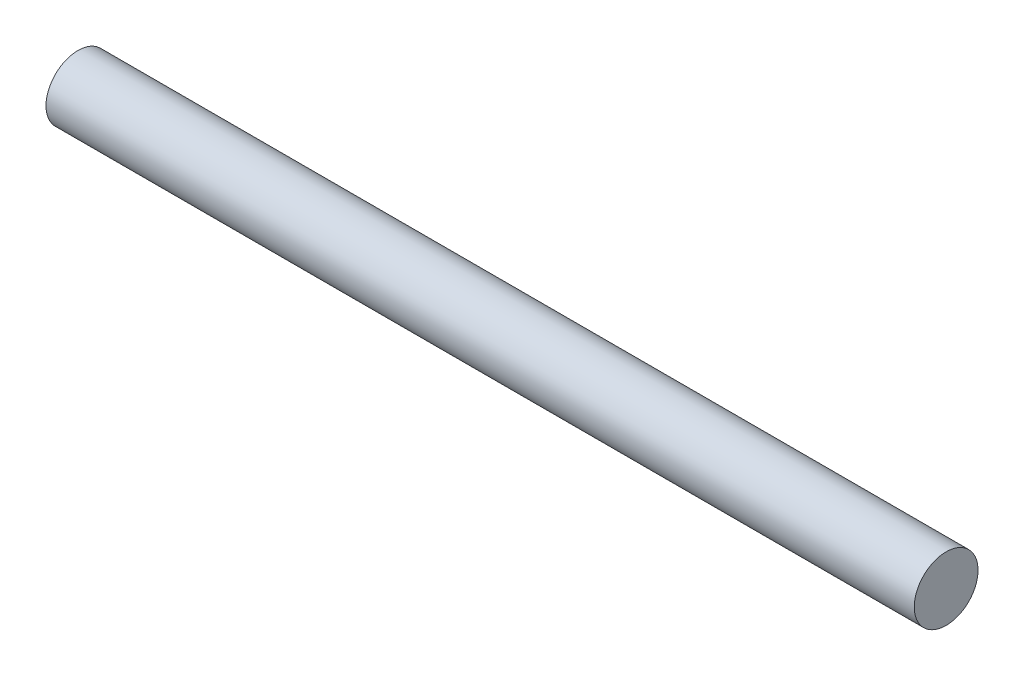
ISO-10303-21;
HEADER;
FILE_DESCRIPTION(('STEP AP214'),'2;1');
FILE_NAME('part.step','',(''),(''),'','','');
FILE_SCHEMA(('AUTOMOTIVE_DESIGN { 1 0 10303 214 1 1 1 1 }'));
ENDSEC;
DATA;
#1=APPLICATION_CONTEXT('core data for automotive mechanical design processes');
#2=APPLICATION_PROTOCOL_DEFINITION('international standard','automotive_design',2000,#1);
#3=PRODUCT_CONTEXT('',#1,'mechanical');
#4=PRODUCT('Part','Part','',(#3));
#5=PRODUCT_RELATED_PRODUCT_CATEGORY('part','',(#4));
#6=PRODUCT_DEFINITION_FORMATION('','',#4);
#7=PRODUCT_DEFINITION_CONTEXT('part definition',#1,'design');
#8=PRODUCT_DEFINITION('design','',#6,#7);
#9=PRODUCT_DEFINITION_SHAPE('','',#8);
#10=(LENGTH_UNIT() NAMED_UNIT(*) SI_UNIT(.MILLI.,.METRE.));
#11=(NAMED_UNIT(*) PLANE_ANGLE_UNIT() SI_UNIT($,.RADIAN.));
#12=(NAMED_UNIT(*) SI_UNIT($,.STERADIAN.) SOLID_ANGLE_UNIT());
#13=UNCERTAINTY_MEASURE_WITH_UNIT(LENGTH_MEASURE(1.E-05),#10,'distance_accuracy_value','');
#14=(GEOMETRIC_REPRESENTATION_CONTEXT(3) GLOBAL_UNCERTAINTY_ASSIGNED_CONTEXT((#13)) GLOBAL_UNIT_ASSIGNED_CONTEXT((#10,
#11,#12)) REPRESENTATION_CONTEXT('',''));
#15=CARTESIAN_POINT('',(0.,0.,0.));
#16=DIRECTION('',(0.,0.,1.));
#17=DIRECTION('',(1.,0.,0.));
#18=AXIS2_PLACEMENT_3D('',#15,#16,#17);
#19=CARTESIAN_POINT('',(38.1,0.,0.));
#20=DIRECTION('',(-1.,0.,0.));
#21=DIRECTION('',(0.,0.,1.));
#22=AXIS2_PLACEMENT_3D('',#19,#20,#21);
#23=CYLINDRICAL_SURFACE('',#22,1.4);
#24=CARTESIAN_POINT('',(38.1,0.,0.));
#25=DIRECTION('',(1.,0.,0.));
#26=DIRECTION('',(0.,0.,-1.));
#27=AXIS2_PLACEMENT_3D('',#24,#25,#26);
#28=CIRCLE('',#27,1.4);
#29=CARTESIAN_POINT('',(38.1,0.,1.4));
#30=VERTEX_POINT('',#29);
#31=EDGE_CURVE('E10',#30,#30,#28,.T.);
#32=CARTESIAN_POINT('',(0.,0.,0.));
#33=DIRECTION('',(1.,0.,0.));
#34=DIRECTION('',(0.,0.,-1.));
#35=AXIS2_PLACEMENT_3D('',#32,#33,#34);
#36=CIRCLE('',#35,1.4);
#37=CARTESIAN_POINT('',(0.,0.,1.4));
#38=VERTEX_POINT('',#37);
#39=EDGE_CURVE('E46',#38,#38,#36,.T.);
#40=CARTESIAN_POINT('',(38.1,0.,1.4));
#41=CARTESIAN_POINT('',(37.703125,0.,1.4));
#42=CARTESIAN_POINT('',(37.30625,0.,1.4));
#43=CARTESIAN_POINT('',(36.5125,0.,1.4));
#44=CARTESIAN_POINT('',(36.115625,0.,1.4));
#45=CARTESIAN_POINT('',(35.321875,0.,1.4));
#46=CARTESIAN_POINT('',(34.925,0.,1.4));
#47=CARTESIAN_POINT('',(34.13125,0.,1.4));
#48=CARTESIAN_POINT('',(33.734375,0.,1.4));
#49=CARTESIAN_POINT('',(32.940625,0.,1.4));
#50=CARTESIAN_POINT('',(32.54375,0.,1.4));
#51=CARTESIAN_POINT('',(31.75,0.,1.4));
#52=CARTESIAN_POINT('',(31.353125,0.,1.4));
#53=CARTESIAN_POINT('',(30.559375,0.,1.4));
#54=CARTESIAN_POINT('',(30.1625,0.,1.4));
#55=CARTESIAN_POINT('',(29.36875,0.,1.4));
#56=CARTESIAN_POINT('',(28.971875,0.,1.4));
#57=CARTESIAN_POINT('',(28.178125,0.,1.4));
#58=CARTESIAN_POINT('',(27.78125,0.,1.4));
#59=CARTESIAN_POINT('',(26.9875,0.,1.4));
#60=CARTESIAN_POINT('',(26.590625,0.,1.4));
#61=CARTESIAN_POINT('',(25.796875,0.,1.4));
#62=CARTESIAN_POINT('',(25.4,0.,1.4));
#63=CARTESIAN_POINT('',(24.60625,0.,1.4));
#64=CARTESIAN_POINT('',(24.209375,0.,1.4));
#65=CARTESIAN_POINT('',(23.415625,0.,1.4));
#66=CARTESIAN_POINT('',(23.01875,0.,1.4));
#67=CARTESIAN_POINT('',(22.225,0.,1.4));
#68=CARTESIAN_POINT('',(21.828125,0.,1.4));
#69=CARTESIAN_POINT('',(21.034375,0.,1.4));
#70=CARTESIAN_POINT('',(20.6375,0.,1.4));
#71=CARTESIAN_POINT('',(19.84375,0.,1.4));
#72=CARTESIAN_POINT('',(19.446875,0.,1.4));
#73=CARTESIAN_POINT('',(18.653125,0.,1.4));
#74=CARTESIAN_POINT('',(18.25625,0.,1.4));
#75=CARTESIAN_POINT('',(17.4625,0.,1.4));
#76=CARTESIAN_POINT('',(17.065625,0.,1.4));
#77=CARTESIAN_POINT('',(16.271875,0.,1.4));
#78=CARTESIAN_POINT('',(15.875,0.,1.4));
#79=CARTESIAN_POINT('',(15.08125,0.,1.4));
#80=CARTESIAN_POINT('',(14.684375,0.,1.4));
#81=CARTESIAN_POINT('',(13.890625,0.,1.4));
#82=CARTESIAN_POINT('',(13.49375,0.,1.4));
#83=CARTESIAN_POINT('',(12.7,0.,1.4));
#84=CARTESIAN_POINT('',(12.303125,0.,1.4));
#85=CARTESIAN_POINT('',(11.509375,0.,1.4));
#86=CARTESIAN_POINT('',(11.1125,0.,1.4));
#87=CARTESIAN_POINT('',(10.31875,0.,1.4));
#88=CARTESIAN_POINT('',(9.92187499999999,0.,1.4));
#89=CARTESIAN_POINT('',(9.128125,0.,1.4));
#90=CARTESIAN_POINT('',(8.73124999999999,0.,1.4));
#91=CARTESIAN_POINT('',(7.93749999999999,0.,1.4));
#92=CARTESIAN_POINT('',(7.54062499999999,0.,1.4));
#93=CARTESIAN_POINT('',(6.746875,0.,1.4));
#94=CARTESIAN_POINT('',(6.35,0.,1.4));
#95=CARTESIAN_POINT('',(5.55625,0.,1.4));
#96=CARTESIAN_POINT('',(5.159375,0.,1.4));
#97=CARTESIAN_POINT('',(4.365625,0.,1.4));
#98=CARTESIAN_POINT('',(3.96875,0.,1.4));
#99=CARTESIAN_POINT('',(3.175,0.,1.4));
#100=CARTESIAN_POINT('',(2.778125,0.,1.4));
#101=CARTESIAN_POINT('',(1.984375,0.,1.4));
#102=CARTESIAN_POINT('',(1.5875,0.,1.4));
#103=CARTESIAN_POINT('',(0.79375,0.,1.4));
#104=CARTESIAN_POINT('',(0.396875,0.,1.4));
#105=CARTESIAN_POINT('',(0.,0.,1.4));
#106=B_SPLINE_CURVE_WITH_KNOTS('',3,(#40,#41,#42,#43,#44,#45,#46,#47,#48,#49,#50,#51,#52,#53,
#54,#55,#56,#57,#58,#59,#60,#61,#62,#63,#64,#65,#66,#67,#68,#69,#70,#71,#72,#73,#74,#75,#76,#77,
#78,#79,#80,#81,#82,#83,#84,#85,#86,#87,#88,#89,#90,#91,#92,#93,#94,#95,#96,#97,#98,#99,#100,
#101,#102,#103,#104,#105),.UNSPECIFIED.,.F.,.F.,(4,2,2,2,2,2,2,2,2,2,2,2,2,2,2,2,2,2,2,2,2,2,2,
2,2,2,2,2,2,2,2,2,4),(0.,1.190625,2.38125,3.571875,4.7625,5.953125,7.14375,8.334375,
9.52500000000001,10.715625,11.90625,13.096875,14.2875,15.478125,16.66875,17.859375,19.05,
20.240625,21.43125,22.621875,23.8125,25.003125,26.19375,27.384375,28.575,29.765625,30.95625,
32.146875,33.3375,34.528125,35.71875,36.909375,38.1),.UNSPECIFIED.);
#107=EDGE_CURVE('BSEAM43',#30,#38,#106,.T.);
#108=ORIENTED_EDGE('',*,*,#31,.F.);
#109=ORIENTED_EDGE('',*,*,#39,.T.);
#110=ORIENTED_EDGE('',*,*,#107,.T.);
#111=ORIENTED_EDGE('',*,*,#107,.F.);
#112=EDGE_LOOP('',(#108,#110,#109,#111));
#113=FACE_BOUND('',#112,.T.);
#114=ADVANCED_FACE('F43',(#113),#23,.T.);
#115=CARTESIAN_POINT('',(38.1,0.,0.));
#116=DIRECTION('',(1.,0.,0.));
#117=DIRECTION('',(0.,0.,-1.));
#118=AXIS2_PLACEMENT_3D('',#115,#116,#117);
#119=PLANE('',#118);
#120=ORIENTED_EDGE('',*,*,#31,.T.);
#121=EDGE_LOOP('',(#120));
#122=FACE_BOUND('',#121,.T.);
#123=ADVANCED_FACE('F58',(#122),#119,.T.);
#124=CARTESIAN_POINT('',(0.,0.,0.));
#125=DIRECTION('',(1.,0.,0.));
#126=DIRECTION('',(0.,0.,-1.));
#127=AXIS2_PLACEMENT_3D('',#124,#125,#126);
#128=PLANE('',#127);
#129=ORIENTED_EDGE('',*,*,#39,.F.);
#130=EDGE_LOOP('',(#129));
#131=FACE_BOUND('',#130,.T.);
#132=ADVANCED_FACE('F59',(#131),#128,.F.);
#133=CLOSED_SHELL('',(#114,#123,#132));
#134=MANIFOLD_SOLID_BREP('B2',#133);
#135=ADVANCED_BREP_SHAPE_REPRESENTATION('',(#18,#134),#14);
#136=SHAPE_DEFINITION_REPRESENTATION(#9,#135);
ENDSEC;
END-ISO-10303-21;
